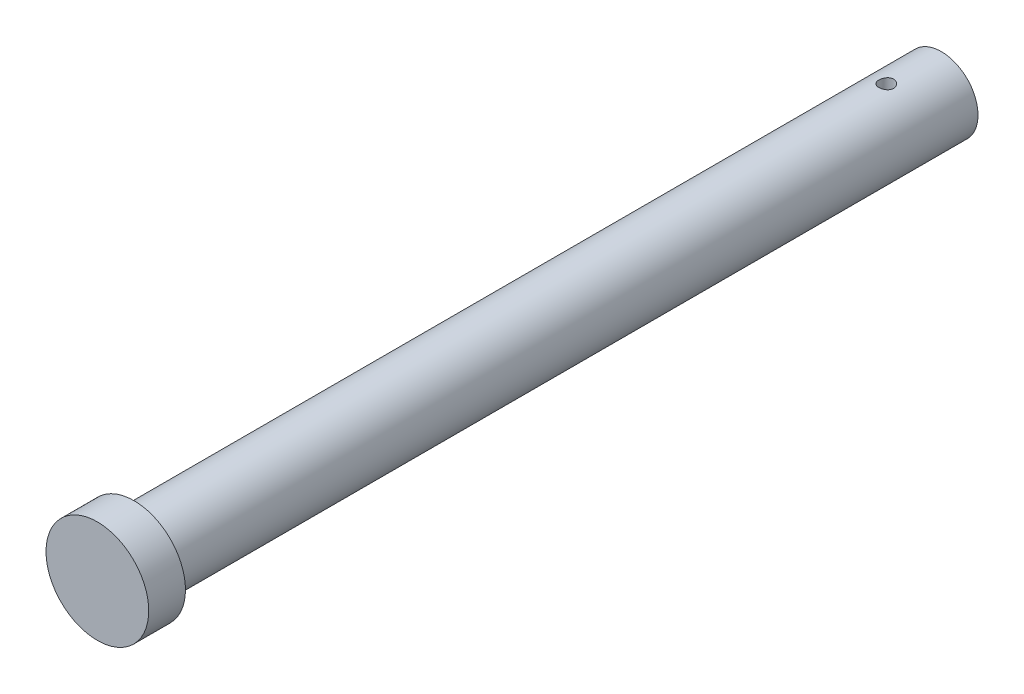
ISO-10303-21;
HEADER;
FILE_DESCRIPTION(('STEP AP214'),'2;1');
FILE_NAME('part.step','',(''),(''),'','','');
FILE_SCHEMA(('AUTOMOTIVE_DESIGN { 1 0 10303 214 1 1 1 1 }'));
ENDSEC;
DATA;
#1=APPLICATION_CONTEXT('core data for automotive mechanical design processes');
#2=APPLICATION_PROTOCOL_DEFINITION('international standard','automotive_design',2000,#1);
#3=PRODUCT_CONTEXT('',#1,'mechanical');
#4=PRODUCT('Part','Part','',(#3));
#5=PRODUCT_RELATED_PRODUCT_CATEGORY('part','',(#4));
#6=PRODUCT_DEFINITION_FORMATION('','',#4);
#7=PRODUCT_DEFINITION_CONTEXT('part definition',#1,'design');
#8=PRODUCT_DEFINITION('design','',#6,#7);
#9=PRODUCT_DEFINITION_SHAPE('','',#8);
#10=(LENGTH_UNIT() NAMED_UNIT(*) SI_UNIT(.MILLI.,.METRE.));
#11=(NAMED_UNIT(*) PLANE_ANGLE_UNIT() SI_UNIT($,.RADIAN.));
#12=(NAMED_UNIT(*) SI_UNIT($,.STERADIAN.) SOLID_ANGLE_UNIT());
#13=UNCERTAINTY_MEASURE_WITH_UNIT(LENGTH_MEASURE(1.E-05),#10,'distance_accuracy_value','');
#14=(GEOMETRIC_REPRESENTATION_CONTEXT(3) GLOBAL_UNCERTAINTY_ASSIGNED_CONTEXT((#13)) GLOBAL_UNIT_ASSIGNED_CONTEXT((#10,
#11,#12)) REPRESENTATION_CONTEXT('',''));
#15=CARTESIAN_POINT('',(0.,0.,0.));
#16=DIRECTION('',(0.,0.,1.));
#17=DIRECTION('',(1.,0.,0.));
#18=AXIS2_PLACEMENT_3D('',#15,#16,#17);
#19=CARTESIAN_POINT('',(0.,0.,75.));
#20=DIRECTION('',(0.,0.,-1.));
#21=DIRECTION('',(-1.,0.,0.));
#22=AXIS2_PLACEMENT_3D('',#19,#20,#21);
#23=CYLINDRICAL_SURFACE('',#22,5.);
#24=CARTESIAN_POINT('',(0.,-5.,-26.5));
#25=CARTESIAN_POINT('',(0.0555769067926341,-4.99999897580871,-26.5000020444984));
#26=CARTESIAN_POINT('',(0.111179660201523,-4.99906385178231,-26.5046488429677));
#27=CARTESIAN_POINT('',(0.22081350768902,-4.99542365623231,-26.5230985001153));
#28=CARTESIAN_POINT('',(0.274843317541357,-4.99271717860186,-26.5369086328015));
#29=CARTESIAN_POINT('',(0.379730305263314,-4.98583649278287,-26.5732412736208));
#30=CARTESIAN_POINT('',(0.430590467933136,-4.98166369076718,-26.5957554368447));
#31=CARTESIAN_POINT('',(0.527807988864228,-4.97230398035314,-26.6488322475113));
#32=CARTESIAN_POINT('',(0.574165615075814,-4.96711713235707,-26.6793944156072));
#33=CARTESIAN_POINT('',(0.661693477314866,-4.9562216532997,-26.7481384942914));
#34=CARTESIAN_POINT('',(0.702793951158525,-4.95050745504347,-26.7864083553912));
#35=CARTESIAN_POINT('',(0.778036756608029,-4.93924180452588,-26.8692924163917));
#36=CARTESIAN_POINT('',(0.812178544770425,-4.93369036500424,-26.9139071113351));
#37=CARTESIAN_POINT('',(0.872831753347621,-4.92332441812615,-27.0087161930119));
#38=CARTESIAN_POINT('',(0.899270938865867,-4.91851707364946,-27.0589576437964));
#39=CARTESIAN_POINT('',(0.94330566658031,-4.91026268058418,-27.1632818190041));
#40=CARTESIAN_POINT('',(0.96090208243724,-4.90681549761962,-27.2173641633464));
#41=CARTESIAN_POINT('',(0.986525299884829,-4.90172805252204,-27.3270843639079));
#42=CARTESIAN_POINT('',(0.994674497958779,-4.90006470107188,-27.3826925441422));
#43=CARTESIAN_POINT('',(1.00155212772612,-4.89866375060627,-27.4945098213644));
#44=CARTESIAN_POINT('',(1.0002815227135,-4.89892595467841,-27.5507188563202));
#45=CARTESIAN_POINT('',(0.98845457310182,-4.90132551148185,-27.661246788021));
#46=CARTESIAN_POINT('',(0.978038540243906,-4.90343452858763,-27.7155814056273));
#47=CARTESIAN_POINT('',(0.948437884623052,-4.90924546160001,-27.821716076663));
#48=CARTESIAN_POINT('',(0.929252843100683,-4.91294745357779,-27.873516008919));
#49=CARTESIAN_POINT('',(0.882524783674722,-4.92155618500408,-27.9735152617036));
#50=CARTESIAN_POINT('',(0.854926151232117,-4.92647089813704,-28.0216878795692));
#51=CARTESIAN_POINT('',(0.792193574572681,-4.93694618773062,-28.1127708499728));
#52=CARTESIAN_POINT('',(0.757058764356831,-4.94250683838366,-28.1556805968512));
#53=CARTESIAN_POINT('',(0.679499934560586,-4.95377021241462,-28.2358294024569));
#54=CARTESIAN_POINT('',(0.636956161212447,-4.95947369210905,-28.2729525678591));
#55=CARTESIAN_POINT('',(0.546185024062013,-4.97028848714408,-28.3395538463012));
#56=CARTESIAN_POINT('',(0.497957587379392,-4.97539979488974,-28.3690318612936));
#57=CARTESIAN_POINT('',(0.397059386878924,-4.98446690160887,-28.419527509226));
#58=CARTESIAN_POINT('',(0.344381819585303,-4.98842088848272,-28.4405318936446));
#59=CARTESIAN_POINT('',(0.236148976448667,-4.99471408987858,-28.4733604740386));
#60=CARTESIAN_POINT('',(0.18059405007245,-4.99705350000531,-28.4851857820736));
#61=CARTESIAN_POINT('',(0.0691794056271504,-4.99982671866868,-28.4991564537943));
#62=CARTESIAN_POINT('',(0.0133403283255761,-5.0002917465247,-28.5014604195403));
#63=CARTESIAN_POINT('',(-0.0979249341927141,-4.99935051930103,-28.4967501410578));
#64=CARTESIAN_POINT('',(-0.153351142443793,-4.99794436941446,-28.4897364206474));
#65=CARTESIAN_POINT('',(-0.261705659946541,-4.99343832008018,-28.4667216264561));
#66=CARTESIAN_POINT('',(-0.314651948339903,-4.99035376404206,-28.4508019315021));
#67=CARTESIAN_POINT('',(-0.417123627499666,-4.98283552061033,-28.4105160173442));
#68=CARTESIAN_POINT('',(-0.466648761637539,-4.97840173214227,-28.3861491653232));
#69=CARTESIAN_POINT('',(-0.561541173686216,-4.96859911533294,-28.3293175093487));
#70=CARTESIAN_POINT('',(-0.606850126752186,-4.96321950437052,-28.2967572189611));
#71=CARTESIAN_POINT('',(-0.691418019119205,-4.95214734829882,-28.2245908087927));
#72=CARTESIAN_POINT('',(-0.730676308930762,-4.94645476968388,-28.1849839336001));
#73=CARTESIAN_POINT('',(-0.802640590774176,-4.93529303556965,-28.0991266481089));
#74=CARTESIAN_POINT('',(-0.835237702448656,-4.92982860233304,-28.0527842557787));
#75=CARTESIAN_POINT('',(-0.892185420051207,-4.91984191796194,-27.9551886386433));
#76=CARTESIAN_POINT('',(-0.916536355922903,-4.91531962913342,-27.9039356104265));
#77=CARTESIAN_POINT('',(-0.956151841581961,-4.90776740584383,-27.7982317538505));
#78=CARTESIAN_POINT('',(-0.971463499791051,-4.90472974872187,-27.7437991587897));
#79=CARTESIAN_POINT('',(-0.992708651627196,-4.90047436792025,-27.6330665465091));
#80=CARTESIAN_POINT('',(-0.998643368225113,-4.89925640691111,-27.5767667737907));
#81=CARTESIAN_POINT('',(-1.00092091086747,-4.89879149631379,-27.4649911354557));
#82=CARTESIAN_POINT('',(-0.997435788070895,-4.89950919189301,-27.409518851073));
#83=CARTESIAN_POINT('',(-0.981352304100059,-4.90275573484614,-27.299968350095));
#84=CARTESIAN_POINT('',(-0.968754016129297,-4.90528456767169,-27.2458901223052));
#85=CARTESIAN_POINT('',(-0.934878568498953,-4.91185264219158,-27.1407722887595));
#86=CARTESIAN_POINT('',(-0.913622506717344,-4.9158882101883,-27.0897256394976));
#87=CARTESIAN_POINT('',(-0.863054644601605,-4.9250171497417,-26.9918962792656));
#88=CARTESIAN_POINT('',(-0.833742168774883,-4.93011060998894,-26.9451139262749));
#89=CARTESIAN_POINT('',(-0.767305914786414,-4.94088960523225,-26.8562844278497));
#90=CARTESIAN_POINT('',(-0.730057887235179,-4.94658372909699,-26.8143312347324));
#91=CARTESIAN_POINT('',(-0.649064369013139,-4.95786081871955,-26.7372137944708));
#92=CARTESIAN_POINT('',(-0.605317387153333,-4.96344375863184,-26.7020511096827));
#93=CARTESIAN_POINT('',(-0.512017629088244,-4.97393832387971,-26.6391653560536));
#94=CARTESIAN_POINT('',(-0.462408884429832,-4.97884231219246,-26.61152399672));
#95=CARTESIAN_POINT('',(-0.35916636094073,-4.98735125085,-26.5650138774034));
#96=CARTESIAN_POINT('',(-0.305536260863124,-4.99095737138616,-26.5461372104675));
#97=CARTESIAN_POINT('',(-0.209821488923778,-4.99576372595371,-26.5213480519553));
#98=CARTESIAN_POINT('',(-0.168281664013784,-4.99734303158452,-26.5133568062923));
#99=CARTESIAN_POINT('',(-0.0844995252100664,-4.99946154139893,-26.5026820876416));
#100=CARTESIAN_POINT('',(-0.0422572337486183,-5.00000077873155,-26.4999984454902));
#101=CARTESIAN_POINT('',(0.,-5.,-26.5));
#102=B_SPLINE_CURVE_WITH_KNOTS('',3,(#24,#25,#26,#27,#28,#29,#30,#31,#32,#33,#34,#35,#36,#37,
#38,#39,#40,#41,#42,#43,#44,#45,#46,#47,#48,#49,#50,#51,#52,#53,#54,#55,#56,#57,#58,#59,#60,#61,
#62,#63,#64,#65,#66,#67,#68,#69,#70,#71,#72,#73,#74,#75,#76,#77,#78,#79,#80,#81,#82,#83,#84,#85,
#86,#87,#88,#89,#90,#91,#92,#93,#94,#95,#96,#97,#98,#99,#100,#101),.UNSPECIFIED.,.T.,.F.,(4,2,2,
2,2,2,2,2,2,2,2,2,2,2,2,2,2,2,2,2,2,2,2,2,2,2,2,2,2,2,2,2,2,2,2,2,2,2,4),(0.,0.166576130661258,
0.333284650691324,0.499833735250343,0.666372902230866,0.834932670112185,1.00350559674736,
1.17361195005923,1.34370149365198,1.51156185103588,1.67940504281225,1.84471727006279,
2.0100373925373,2.17647490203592,2.3429315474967,2.51238252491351,2.6818356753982,
2.85155274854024,3.02124925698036,3.18810735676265,3.35495607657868,3.52030453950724,
3.68566539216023,3.85305066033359,4.0204538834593,4.19040628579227,4.36035188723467,
4.52940381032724,4.69843368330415,4.86439722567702,5.03035943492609,5.1959196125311,
5.36149367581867,5.52988076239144,5.69830654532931,5.86849496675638,6.03852955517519,
6.16518775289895,6.29184191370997),.UNSPECIFIED.);
#103=CARTESIAN_POINT('',(0.,-5.,-26.5));
#104=VERTEX_POINT('',#103);
#105=EDGE_CURVE('E31',#104,#104,#102,.T.);
#106=ORIENTED_EDGE('',*,*,#105,.T.);
#107=EDGE_LOOP('',(#106));
#108=FACE_BOUND('',#107,.T.);
#109=CARTESIAN_POINT('',(0.,5.,-26.5));
#110=CARTESIAN_POINT('',(-0.0555769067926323,4.99999897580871,-26.5000020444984));
#111=CARTESIAN_POINT('',(-0.111179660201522,4.99906385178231,-26.5046488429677));
#112=CARTESIAN_POINT('',(-0.220813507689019,4.99542365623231,-26.5230985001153));
#113=CARTESIAN_POINT('',(-0.274843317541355,4.99271717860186,-26.5369086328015));
#114=CARTESIAN_POINT('',(-0.379730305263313,4.98583649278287,-26.5732412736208));
#115=CARTESIAN_POINT('',(-0.430590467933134,4.98166369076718,-26.5957554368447));
#116=CARTESIAN_POINT('',(-0.527807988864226,4.97230398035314,-26.6488322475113));
#117=CARTESIAN_POINT('',(-0.574165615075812,4.96711713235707,-26.6793944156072));
#118=CARTESIAN_POINT('',(-0.661693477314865,4.9562216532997,-26.7481384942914));
#119=CARTESIAN_POINT('',(-0.702793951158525,4.95050745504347,-26.7864083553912));
#120=CARTESIAN_POINT('',(-0.778036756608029,4.93924180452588,-26.8692924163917));
#121=CARTESIAN_POINT('',(-0.812178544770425,4.93369036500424,-26.9139071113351));
#122=CARTESIAN_POINT('',(-0.87283175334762,4.92332441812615,-27.0087161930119));
#123=CARTESIAN_POINT('',(-0.899270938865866,4.91851707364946,-27.0589576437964));
#124=CARTESIAN_POINT('',(-0.943305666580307,4.91026268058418,-27.1632818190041));
#125=CARTESIAN_POINT('',(-0.960902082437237,4.90681549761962,-27.2173641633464));
#126=CARTESIAN_POINT('',(-0.986525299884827,4.90172805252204,-27.3270843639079));
#127=CARTESIAN_POINT('',(-0.994674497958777,4.90006470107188,-27.3826925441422));
#128=CARTESIAN_POINT('',(-1.00155212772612,4.89866375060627,-27.4945098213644));
#129=CARTESIAN_POINT('',(-1.0002815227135,4.89892595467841,-27.5507188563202));
#130=CARTESIAN_POINT('',(-0.988454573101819,4.90132551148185,-27.661246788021));
#131=CARTESIAN_POINT('',(-0.978038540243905,4.90343452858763,-27.7155814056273));
#132=CARTESIAN_POINT('',(-0.948437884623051,4.90924546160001,-27.821716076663));
#133=CARTESIAN_POINT('',(-0.929252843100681,4.91294745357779,-27.873516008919));
#134=CARTESIAN_POINT('',(-0.88252478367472,4.92155618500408,-27.9735152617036));
#135=CARTESIAN_POINT('',(-0.854926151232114,4.92647089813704,-28.0216878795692));
#136=CARTESIAN_POINT('',(-0.792193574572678,4.93694618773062,-28.1127708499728));
#137=CARTESIAN_POINT('',(-0.757058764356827,4.94250683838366,-28.1556805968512));
#138=CARTESIAN_POINT('',(-0.679499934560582,4.95377021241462,-28.2358294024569));
#139=CARTESIAN_POINT('',(-0.636956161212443,4.95947369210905,-28.2729525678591));
#140=CARTESIAN_POINT('',(-0.546185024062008,4.97028848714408,-28.3395538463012));
#141=CARTESIAN_POINT('',(-0.497957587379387,4.97539979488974,-28.3690318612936));
#142=CARTESIAN_POINT('',(-0.397059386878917,4.98446690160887,-28.419527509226));
#143=CARTESIAN_POINT('',(-0.344381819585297,4.98842088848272,-28.4405318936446));
#144=CARTESIAN_POINT('',(-0.236148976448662,4.99471408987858,-28.4733604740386));
#145=CARTESIAN_POINT('',(-0.180594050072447,4.99705350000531,-28.4851857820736));
#146=CARTESIAN_POINT('',(-0.0691794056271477,4.99982671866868,-28.4991564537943));
#147=CARTESIAN_POINT('',(-0.0133403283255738,5.0002917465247,-28.5014604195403));
#148=CARTESIAN_POINT('',(0.097924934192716,4.99935051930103,-28.4967501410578));
#149=CARTESIAN_POINT('',(0.153351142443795,4.99794436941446,-28.4897364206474));
#150=CARTESIAN_POINT('',(0.261705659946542,4.99343832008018,-28.4667216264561));
#151=CARTESIAN_POINT('',(0.314651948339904,4.99035376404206,-28.4508019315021));
#152=CARTESIAN_POINT('',(0.417123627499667,4.98283552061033,-28.4105160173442));
#153=CARTESIAN_POINT('',(0.46664876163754,4.97840173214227,-28.3861491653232));
#154=CARTESIAN_POINT('',(0.561541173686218,4.96859911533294,-28.3293175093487));
#155=CARTESIAN_POINT('',(0.606850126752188,4.96321950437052,-28.2967572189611));
#156=CARTESIAN_POINT('',(0.691418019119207,4.95214734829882,-28.2245908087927));
#157=CARTESIAN_POINT('',(0.730676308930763,4.94645476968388,-28.1849839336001));
#158=CARTESIAN_POINT('',(0.802640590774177,4.93529303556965,-28.0991266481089));
#159=CARTESIAN_POINT('',(0.835237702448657,4.92982860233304,-28.0527842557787));
#160=CARTESIAN_POINT('',(0.892185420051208,4.91984191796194,-27.9551886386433));
#161=CARTESIAN_POINT('',(0.916536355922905,4.91531962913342,-27.9039356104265));
#162=CARTESIAN_POINT('',(0.956151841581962,4.90776740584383,-27.7982317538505));
#163=CARTESIAN_POINT('',(0.971463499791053,4.90472974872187,-27.7437991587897));
#164=CARTESIAN_POINT('',(0.992708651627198,4.90047436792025,-27.6330665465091));
#165=CARTESIAN_POINT('',(0.998643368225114,4.89925640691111,-27.5767667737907));
#166=CARTESIAN_POINT('',(1.00092091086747,4.89879149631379,-27.4649911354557));
#167=CARTESIAN_POINT('',(0.997435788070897,4.89950919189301,-27.409518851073));
#168=CARTESIAN_POINT('',(0.981352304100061,4.90275573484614,-27.299968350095));
#169=CARTESIAN_POINT('',(0.968754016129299,4.90528456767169,-27.2458901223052));
#170=CARTESIAN_POINT('',(0.934878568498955,4.91185264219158,-27.1407722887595));
#171=CARTESIAN_POINT('',(0.913622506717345,4.9158882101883,-27.0897256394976));
#172=CARTESIAN_POINT('',(0.863054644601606,4.9250171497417,-26.9918962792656));
#173=CARTESIAN_POINT('',(0.833742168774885,4.93011060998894,-26.9451139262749));
#174=CARTESIAN_POINT('',(0.767305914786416,4.94088960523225,-26.8562844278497));
#175=CARTESIAN_POINT('',(0.730057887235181,4.94658372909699,-26.8143312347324));
#176=CARTESIAN_POINT('',(0.649064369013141,4.95786081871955,-26.7372137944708));
#177=CARTESIAN_POINT('',(0.605317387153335,4.96344375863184,-26.7020511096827));
#178=CARTESIAN_POINT('',(0.512017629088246,4.97393832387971,-26.6391653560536));
#179=CARTESIAN_POINT('',(0.462408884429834,4.97884231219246,-26.61152399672));
#180=CARTESIAN_POINT('',(0.359166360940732,4.98735125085,-26.5650138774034));
#181=CARTESIAN_POINT('',(0.305536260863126,4.99095737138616,-26.5461372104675));
#182=CARTESIAN_POINT('',(0.209821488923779,4.99576372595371,-26.5213480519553));
#183=CARTESIAN_POINT('',(0.168281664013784,4.99734303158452,-26.5133568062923));
#184=CARTESIAN_POINT('',(0.084499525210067,4.99946154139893,-26.5026820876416));
#185=CARTESIAN_POINT('',(0.0422572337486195,5.00000077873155,-26.4999984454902));
#186=CARTESIAN_POINT('',(0.,5.,-26.5));
#187=B_SPLINE_CURVE_WITH_KNOTS('',3,(#109,#110,#111,#112,#113,#114,#115,#116,#117,#118,#119,
#120,#121,#122,#123,#124,#125,#126,#127,#128,#129,#130,#131,#132,#133,#134,#135,#136,#137,#138,
#139,#140,#141,#142,#143,#144,#145,#146,#147,#148,#149,#150,#151,#152,#153,#154,#155,#156,#157,
#158,#159,#160,#161,#162,#163,#164,#165,#166,#167,#168,#169,#170,#171,#172,#173,#174,#175,#176,
#177,#178,#179,#180,#181,#182,#183,#184,#185,#186),.UNSPECIFIED.,.T.,.F.,(4,2,2,2,2,2,2,2,2,2,2,
2,2,2,2,2,2,2,2,2,2,2,2,2,2,2,2,2,2,2,2,2,2,2,2,2,2,2,4),(0.,0.166576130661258,
0.333284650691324,0.499833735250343,0.666372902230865,0.834932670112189,1.00350559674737,
1.17361195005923,1.34370149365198,1.51156185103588,1.67940504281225,1.84471727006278,
2.0100373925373,2.17647490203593,2.34293154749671,2.51238252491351,2.68183567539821,
2.85155274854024,3.02124925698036,3.18810735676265,3.35495607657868,3.52030453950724,
3.68566539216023,3.85305066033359,4.0204538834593,4.19040628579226,4.36035188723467,
4.52940381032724,4.69843368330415,4.86439722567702,5.03035943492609,5.1959196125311,
5.36149367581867,5.52988076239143,5.69830654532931,5.86849496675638,6.03852955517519,
6.16518775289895,6.29184191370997),.UNSPECIFIED.);
#188=CARTESIAN_POINT('',(0.,5.,-26.5));
#189=VERTEX_POINT('',#188);
#190=EDGE_CURVE('E46',#189,#189,#187,.T.);
#191=ORIENTED_EDGE('',*,*,#190,.T.);
#192=EDGE_LOOP('',(#191));
#193=FACE_BOUND('',#192,.T.);
#194=CARTESIAN_POINT('',(0.,0.,75.));
#195=DIRECTION('',(0.,0.,1.));
#196=DIRECTION('',(1.,0.,0.));
#197=AXIS2_PLACEMENT_3D('',#194,#195,#196);
#198=CIRCLE('',#197,5.);
#199=CARTESIAN_POINT('',(5.,0.,75.));
#200=VERTEX_POINT('',#199);
#201=EDGE_CURVE('E10',#200,#200,#198,.T.);
#202=ORIENTED_EDGE('',*,*,#201,.F.);
#203=EDGE_LOOP('',(#202));
#204=FACE_BOUND('',#203,.T.);
#205=CARTESIAN_POINT('',(0.,0.,-35.));
#206=DIRECTION('',(0.,0.,1.));
#207=DIRECTION('',(1.,0.,0.));
#208=AXIS2_PLACEMENT_3D('',#205,#206,#207);
#209=CIRCLE('',#208,5.);
#210=CARTESIAN_POINT('',(5.,0.,-35.));
#211=VERTEX_POINT('',#210);
#212=EDGE_CURVE('E38',#211,#211,#209,.T.);
#213=ORIENTED_EDGE('',*,*,#212,.T.);
#214=EDGE_LOOP('',(#213));
#215=FACE_BOUND('',#214,.T.);
#216=ADVANCED_FACE('F27',(#108,#193,#204,#215),#23,.T.);
#217=CARTESIAN_POINT('',(0.,0.,-35.));
#218=DIRECTION('',(0.,0.,1.));
#219=DIRECTION('',(1.,0.,0.));
#220=AXIS2_PLACEMENT_3D('',#217,#218,#219);
#221=PLANE('',#220);
#222=ORIENTED_EDGE('',*,*,#212,.F.);
#223=EDGE_LOOP('',(#222));
#224=FACE_BOUND('',#223,.T.);
#225=ADVANCED_FACE('F61',(#224),#221,.F.);
#226=CARTESIAN_POINT('',(0.,0.,75.));
#227=DIRECTION('',(0.,0.,1.));
#228=DIRECTION('',(1.,0.,0.));
#229=AXIS2_PLACEMENT_3D('',#226,#227,#228);
#230=PLANE('',#229);
#231=CARTESIAN_POINT('',(0.,0.,75.));
#232=DIRECTION('',(0.,0.,1.));
#233=DIRECTION('',(1.,0.,0.));
#234=AXIS2_PLACEMENT_3D('',#231,#232,#233);
#235=CIRCLE('',#234,7.);
#236=CARTESIAN_POINT('',(-7.,0.,75.));
#237=VERTEX_POINT('',#236);
#238=EDGE_CURVE('E84',#237,#237,#235,.T.);
#239=ORIENTED_EDGE('',*,*,#238,.F.);
#240=EDGE_LOOP('',(#239));
#241=FACE_BOUND('',#240,.T.);
#242=ORIENTED_EDGE('',*,*,#201,.T.);
#243=EDGE_LOOP('',(#242));
#244=FACE_BOUND('',#243,.T.);
#245=ADVANCED_FACE('F56',(#241,#244),#230,.F.);
#246=CARTESIAN_POINT('',(0.,0.,80.));
#247=DIRECTION('',(0.,0.,-1.));
#248=DIRECTION('',(-1.,0.,0.));
#249=AXIS2_PLACEMENT_3D('',#246,#247,#248);
#250=CYLINDRICAL_SURFACE('',#249,7.);
#251=CARTESIAN_POINT('',(0.,0.,80.));
#252=DIRECTION('',(0.,0.,1.));
#253=DIRECTION('',(1.,0.,0.));
#254=AXIS2_PLACEMENT_3D('',#251,#252,#253);
#255=CIRCLE('',#254,7.);
#256=CARTESIAN_POINT('',(-7.,0.,80.));
#257=VERTEX_POINT('',#256);
#258=EDGE_CURVE('E43',#257,#257,#255,.T.);
#259=CARTESIAN_POINT('',(-7.,0.,80.));
#260=CARTESIAN_POINT('',(-7.,0.,79.9479166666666));
#261=CARTESIAN_POINT('',(-7.,0.,79.8958333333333));
#262=CARTESIAN_POINT('',(-7.,0.,79.7916666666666));
#263=CARTESIAN_POINT('',(-7.,0.,79.7395833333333));
#264=CARTESIAN_POINT('',(-7.,0.,79.6354166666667));
#265=CARTESIAN_POINT('',(-7.,0.,79.5833333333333));
#266=CARTESIAN_POINT('',(-7.,0.,79.4791666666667));
#267=CARTESIAN_POINT('',(-7.,0.,79.4270833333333));
#268=CARTESIAN_POINT('',(-7.,0.,79.3229166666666));
#269=CARTESIAN_POINT('',(-7.,0.,79.2708333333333));
#270=CARTESIAN_POINT('',(-7.,0.,79.1666666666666));
#271=CARTESIAN_POINT('',(-7.,0.,79.1145833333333));
#272=CARTESIAN_POINT('',(-7.,0.,79.0104166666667));
#273=CARTESIAN_POINT('',(-7.,0.,78.9583333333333));
#274=CARTESIAN_POINT('',(-7.,0.,78.8541666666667));
#275=CARTESIAN_POINT('',(-7.,0.,78.8020833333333));
#276=CARTESIAN_POINT('',(-7.,0.,78.6979166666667));
#277=CARTESIAN_POINT('',(-7.,0.,78.6458333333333));
#278=CARTESIAN_POINT('',(-7.,0.,78.5416666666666));
#279=CARTESIAN_POINT('',(-7.,0.,78.4895833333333));
#280=CARTESIAN_POINT('',(-7.,0.,78.3854166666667));
#281=CARTESIAN_POINT('',(-7.,0.,78.3333333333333));
#282=CARTESIAN_POINT('',(-7.,0.,78.2291666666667));
#283=CARTESIAN_POINT('',(-7.,0.,78.1770833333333));
#284=CARTESIAN_POINT('',(-7.,0.,78.0729166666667));
#285=CARTESIAN_POINT('',(-7.,0.,78.0208333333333));
#286=CARTESIAN_POINT('',(-7.,0.,77.9166666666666));
#287=CARTESIAN_POINT('',(-7.,0.,77.8645833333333));
#288=CARTESIAN_POINT('',(-7.,0.,77.7604166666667));
#289=CARTESIAN_POINT('',(-7.,0.,77.7083333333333));
#290=CARTESIAN_POINT('',(-7.,0.,77.6041666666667));
#291=CARTESIAN_POINT('',(-7.,0.,77.5520833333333));
#292=CARTESIAN_POINT('',(-7.,0.,77.4479166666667));
#293=CARTESIAN_POINT('',(-7.,0.,77.3958333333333));
#294=CARTESIAN_POINT('',(-7.,0.,77.2916666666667));
#295=CARTESIAN_POINT('',(-7.,0.,77.2395833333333));
#296=CARTESIAN_POINT('',(-7.,0.,77.1354166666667));
#297=CARTESIAN_POINT('',(-7.,0.,77.0833333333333));
#298=CARTESIAN_POINT('',(-7.,0.,76.9791666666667));
#299=CARTESIAN_POINT('',(-7.,0.,76.9270833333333));
#300=CARTESIAN_POINT('',(-7.,0.,76.8229166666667));
#301=CARTESIAN_POINT('',(-7.,0.,76.7708333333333));
#302=CARTESIAN_POINT('',(-7.,0.,76.6666666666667));
#303=CARTESIAN_POINT('',(-7.,0.,76.6145833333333));
#304=CARTESIAN_POINT('',(-7.,0.,76.5104166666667));
#305=CARTESIAN_POINT('',(-7.,0.,76.4583333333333));
#306=CARTESIAN_POINT('',(-7.,0.,76.3541666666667));
#307=CARTESIAN_POINT('',(-7.,0.,76.3020833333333));
#308=CARTESIAN_POINT('',(-7.,0.,76.1979166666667));
#309=CARTESIAN_POINT('',(-7.,0.,76.1458333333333));
#310=CARTESIAN_POINT('',(-7.,0.,76.0416666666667));
#311=CARTESIAN_POINT('',(-7.,0.,75.9895833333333));
#312=CARTESIAN_POINT('',(-7.,0.,75.8854166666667));
#313=CARTESIAN_POINT('',(-7.,0.,75.8333333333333));
#314=CARTESIAN_POINT('',(-7.,0.,75.7291666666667));
#315=CARTESIAN_POINT('',(-7.,0.,75.6770833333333));
#316=CARTESIAN_POINT('',(-7.,0.,75.5729166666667));
#317=CARTESIAN_POINT('',(-7.,0.,75.5208333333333));
#318=CARTESIAN_POINT('',(-7.,0.,75.4166666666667));
#319=CARTESIAN_POINT('',(-7.,0.,75.3645833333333));
#320=CARTESIAN_POINT('',(-7.,0.,75.2604166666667));
#321=CARTESIAN_POINT('',(-7.,0.,75.2083333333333));
#322=CARTESIAN_POINT('',(-7.,0.,75.1041666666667));
#323=CARTESIAN_POINT('',(-7.,0.,75.0520833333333));
#324=CARTESIAN_POINT('',(-7.,0.,75.));
#325=B_SPLINE_CURVE_WITH_KNOTS('',3,(#259,#260,#261,#262,#263,#264,#265,#266,#267,#268,#269,
#270,#271,#272,#273,#274,#275,#276,#277,#278,#279,#280,#281,#282,#283,#284,#285,#286,#287,#288,
#289,#290,#291,#292,#293,#294,#295,#296,#297,#298,#299,#300,#301,#302,#303,#304,#305,#306,#307,
#308,#309,#310,#311,#312,#313,#314,#315,#316,#317,#318,#319,#320,#321,#322,#323,#324),
.UNSPECIFIED.,.F.,.F.,(4,2,2,2,2,2,2,2,2,2,2,2,2,2,2,2,2,2,2,2,2,2,2,2,2,2,2,2,2,2,2,2,4),(0.,
0.156250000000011,0.312500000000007,0.468750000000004,0.625000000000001,0.781250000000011,
0.937500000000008,1.09375,1.25,1.40625,1.56250000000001,1.71875,1.875,2.03125,2.18750000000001,
2.34375000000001,2.5,2.65625,2.8125,2.96875000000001,3.125,3.28125,3.4375,3.59375000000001,3.75,
3.90625,4.0625,4.21874999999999,4.375,4.53125,4.6875,4.84374999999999,4.99999999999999),.UNSPECIFIED.);
#326=EDGE_CURVE('BSEAM60',#257,#237,#325,.T.);
#327=ORIENTED_EDGE('',*,*,#258,.F.);
#328=ORIENTED_EDGE('',*,*,#238,.T.);
#329=ORIENTED_EDGE('',*,*,#326,.T.);
#330=ORIENTED_EDGE('',*,*,#326,.F.);
#331=EDGE_LOOP('',(#327,#329,#328,#330));
#332=FACE_BOUND('',#331,.T.);
#333=ADVANCED_FACE('F60',(#332),#250,.T.);
#334=CARTESIAN_POINT('',(0.,0.,80.));
#335=DIRECTION('',(0.,0.,1.));
#336=DIRECTION('',(1.,0.,0.));
#337=AXIS2_PLACEMENT_3D('',#334,#335,#336);
#338=PLANE('',#337);
#339=ORIENTED_EDGE('',*,*,#258,.T.);
#340=EDGE_LOOP('',(#339));
#341=FACE_BOUND('',#340,.T.);
#342=ADVANCED_FACE('F54',(#341),#338,.T.);
#343=CARTESIAN_POINT('',(0.,-10.,-27.5));
#344=DIRECTION('',(0.,1.,0.));
#345=DIRECTION('',(0.,0.,1.));
#346=AXIS2_PLACEMENT_3D('',#343,#344,#345);
#347=CYLINDRICAL_SURFACE('',#346,1.);
#348=ORIENTED_EDGE('',*,*,#190,.F.);
#349=EDGE_LOOP('',(#348));
#350=FACE_BOUND('',#349,.T.);
#351=ORIENTED_EDGE('',*,*,#105,.F.);
#352=EDGE_LOOP('',(#351));
#353=FACE_BOUND('',#352,.T.);
#354=ADVANCED_FACE('F50',(#350,#353),#347,.F.);
#355=CLOSED_SHELL('',(#216,#225,#245,#333,#342,#354));
#356=MANIFOLD_SOLID_BREP('B2',#355);
#357=ADVANCED_BREP_SHAPE_REPRESENTATION('',(#18,#356),#14);
#358=SHAPE_DEFINITION_REPRESENTATION(#9,#357);
ENDSEC;
END-ISO-10303-21;
